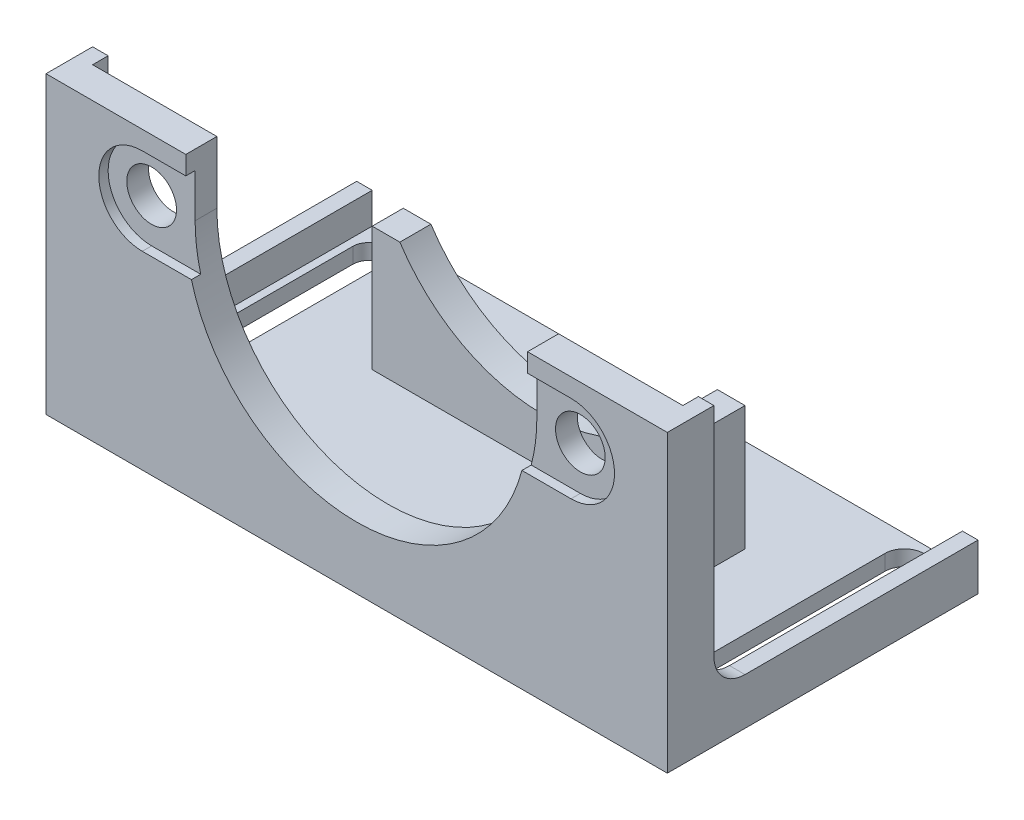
from build123d import *

# Parameters (mm, degrees)
SKETCH1_W           = 50.8
SKETCH1_H           = 24.13
BOSS_EXTRUDE1_DEPTH = 25.4
SKETCH2_R           = 2.032
CUT_EXTRUDE1_DEPTH  = 62.709455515
SKETCH3_W           = 48.26
SKETCH3_H           = 24.497684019
CUT_EXTRUDE2_DEPTH  = 22.86
CUT_EXTRUDE5_DEPTH  = 0.762
SKETCH6_W           = 27.94
SKETCH6_H           = 2.54
BOSS_EXTRUDE3_DEPTH = 10.16
CUT_EXTRUDE6_DEPTH  = 59.267954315
SKETCH11_W          = 30.423176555
SKETCH11_H          = 36.785715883
CUT_EXTRUDE8_DEPTH  = 2.54
SKETCH12_W          = 27.763315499
SKETCH12_H          = 29.057334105
CUT_EXTRUDE9_DEPTH  = 2.54
FILLET1_R           = 2.54
CUT_EXTRUDE10_DEPTH = 62.224011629


with BuildPart() as part:
    # Sketch1 → Boss-Extrude1 (new body)
    with BuildSketch(Plane.XY):
        with Locations((25.4, 12.065)):
            Rectangle(SKETCH1_W, SKETCH1_H)
    extrude(amount=BOSS_EXTRUDE1_DEPTH)

    # Sketch2 → Cut-Extrude1 (cut, through all)
    with BuildSketch(Plane.XY.offset(25.4)):
        with Locations((7.874, 19.05)):
            Circle(SKETCH2_R)
        with Locations((42.926, 19.05)):
            Circle(SKETCH2_R)
        with BuildLine():
            Line((11.43, 19.05), (11.43, 33.02))
            Line((11.43, 33.02), (39.37, 33.02))
            Line((39.37, 33.02), (39.37, 19.05))
            ThreePointArc((39.37, 19.05), (25.4, 5.08), (11.43, 19.05))
        make_face()
    extrude(amount=-CUT_EXTRUDE1_DEPTH, mode=Mode.SUBTRACT)

    # Sketch3 → Cut-Extrude2 (cut)
    with BuildSketch(Plane(origin=(0, 24.13, 0), x_dir=(1, 0, 0), z_dir=(0, 1, 0))):
        with Locations((25.4, -10.611157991)):
            Rectangle(SKETCH3_W, SKETCH3_H)
    extrude(amount=-CUT_EXTRUDE2_DEPTH, mode=Mode.SUBTRACT)

    # Sketch5 → Cut-Extrude5 (cut)
    with BuildSketch(Plane.XY.offset(25.4)):
        with BuildLine():
            Line((7.874, 22.606), (42.926, 22.606))
            ThreePointArc((42.926, 22.606), (46.482, 19.05), (42.926, 15.494))
            Line((42.926, 15.494), (7.874, 15.494))
            ThreePointArc((7.874, 15.494), (4.318, 19.05), (7.874, 22.606))
        make_face()
    extrude(amount=-CUT_EXTRUDE5_DEPTH, mode=Mode.SUBTRACT)

    # Sketch6 → Boss-Extrude3 (add)
    with BuildSketch(Plane(origin=(0, 1.27, 0), x_dir=(1, 0, 0), z_dir=(0, 1, 0))):
        with Locations((25.4, -8.89)):
            Rectangle(SKETCH6_W, SKETCH6_H)
    extrude(amount=BOSS_EXTRUDE3_DEPTH)

    # Sketch7 → Cut-Extrude6 (cut, through all)
    with BuildSketch(Plane.XY.offset(10.16)):
        with BuildLine():
            Line((11.43, 19.05), (11.43, 24.13))
            Line((11.43, 24.13), (39.37, 24.13))
            Line((39.37, 24.13), (39.37, 19.05))
            ThreePointArc((39.37, 19.05), (25.4, 5.08), (11.43, 19.05))
        make_face()
    extrude(amount=-CUT_EXTRUDE6_DEPTH, mode=Mode.SUBTRACT)

    # Sketch11 → Cut-Extrude8 (cut)
    with BuildSketch(Plane.ZY):
        with Locations((6.378411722, 22.202857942)):
            Rectangle(SKETCH11_W, SKETCH11_H)
    extrude(amount=-CUT_EXTRUDE8_DEPTH, mode=Mode.SUBTRACT)

    # Sketch12 → Cut-Extrude9 (cut)
    with BuildSketch(Plane(origin=(50.8, 0, 0), x_dir=(0, 0, -1), z_dir=(1, 0, 0))):
        with Locations((-7.70834225, 18.338667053)):
            Rectangle(SKETCH12_W, SKETCH12_H)
    extrude(amount=-CUT_EXTRUDE9_DEPTH, mode=Mode.SUBTRACT)

    # Fillet1
    fillet1_edges = [part.edges().sort_by_distance(p)[0] for p in [
        (0.635, 3.81, 21.59),
        (50.165, 3.81, 21.59),
    ]]
    fillet(fillet1_edges, radius=FILLET1_R)

    # Sketch14 → Cut-Extrude10 (cut, through all)
    with BuildSketch(Plane(origin=(0, 1.27, 0), x_dir=(1, 0, 0), z_dir=(0, 1, 0))):
        with BuildLine():
            Line((4.445, -2.21563555), (4.445, -19.99563555))
            ThreePointArc((4.445, -19.99563555), (3.175, -21.26563555), (1.905, -19.99563555))
            Line((1.905, -19.99563555), (1.905, -2.21563555))
            ThreePointArc((1.905, -2.21563555), (3.175, -0.94563555), (4.445, -2.21563555))
        make_face()
        with BuildLine():
            Line((48.5775, -2.21563555), (48.5775, -19.99563555))
            ThreePointArc((48.5775, -19.99563555), (46.99, -21.58313555), (45.4025, -19.99563555))
            Line((45.4025, -19.99563555), (45.4025, -2.21563555))
            ThreePointArc((45.4025, -2.21563555), (46.99, -0.62813555), (48.5775, -2.21563555))
        make_face()
    extrude(amount=-CUT_EXTRUDE10_DEPTH, mode=Mode.SUBTRACT)


solid = part.part
